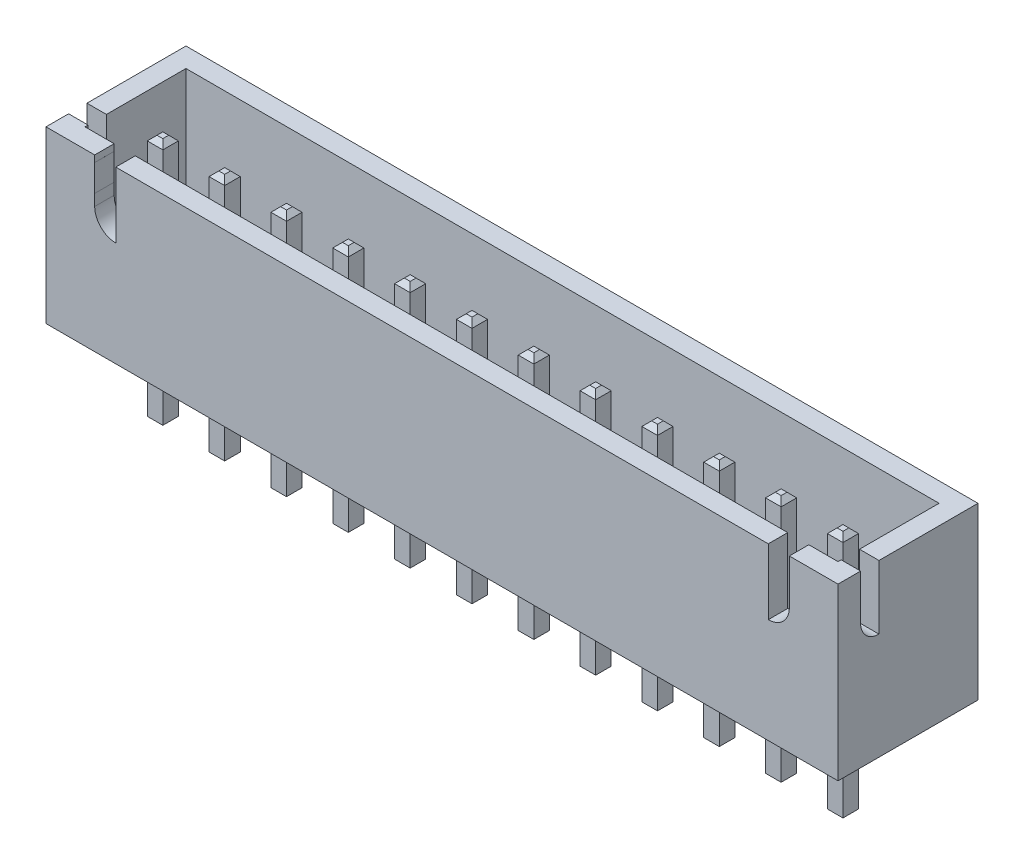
from build123d import *

# Parameters (mm, degrees)
SKETCH1_W                = 32.5374
SKETCH1_H                = 5.75
BOSS_EXTRUDE1_DEPTH      = 7
SHELL1_T                 = -0.8
CUT_EXTRUDE1_DEPTH       = 34.405808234
CUT_EXTRUDE2_REACH       = 20.621
BOSS_EXTRUDE2_DEPTH      = 3.45
BOSS_EXTRUDE2_DEPTH_BACK = 6.75
SKETCH4_W                = 0.64
SKETCH4_H                = 0.64
CHAMFER1_SIZE            = 0.2


with BuildPart() as part:
    # Sketch1 → Boss-Extrude1 (new body)
    with BuildSketch(Plane(origin=(0, 0, 0), x_dir=(1, 0, 0), z_dir=(0, 1, 0))):
        Rectangle(SKETCH1_W, SKETCH1_H)
    extrude(amount=BOSS_EXTRUDE1_DEPTH)

    # Shell1
    shell1_openings = [part.faces().sort_by_distance(p)[0] for p in [
        (0, 7, 0),
    ]]
    offset(amount=SHELL1_T, openings=shell1_openings, kind=Kind.INTERSECTION)

    # Sketch2 → Cut-Extrude1 (cut, through all)
    with BuildSketch(Plane(origin=(16.2687, 0, 0), x_dir=(0, 0, -1), z_dir=(1, 0, 0))):
        with BuildLine():
            Line((-1.19301282, 7), (-1.19301282, 4.379603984))
            ThreePointArc((-1.19301282, 4.379603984), (-1.72610374, 4.600417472), (-1.946917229, 5.133508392))
            Line((-1.946917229, 5.133508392), (-1.946917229, 7))
            Line((-1.946917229, 7), (-1.19301282, 7))
        make_face()
    extrude(amount=-CUT_EXTRUDE1_DEPTH, mode=Mode.SUBTRACT)

    # Sketch3 → Cut-Extrude2 (cut, up to next)
    with BuildSketch(Plane.XY.offset(2.875), mode=Mode.PRIVATE) as cut_extrude2_sk1:
        with BuildLine():
            Line((-14.2687, 7), (-14.2687, 6.728922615))
            Line((-14.2687, 6.728922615), (-14.2687, 5.629880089))
            Line((-14.2687, 5.629880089), (-14.2687, 5.166308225))
            ThreePointArc((-14.2687, 5.166308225), (-14.014986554, 4.553789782), (-13.40246811, 4.300076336))
            Line((-13.40246811, 4.300076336), (-13.40246811, 7))
            Line((-13.40246811, 7), (-14.2687, 7))
        make_face()
    cut_extrude2_tool1 = extrude(cut_extrude2_sk1.sketch, amount=-CUT_EXTRUDE2_REACH, mode=Mode.PRIVATE) & part.part
    # Sketch3 → Cut-Extrude2 (cut, up to next)
    with BuildSketch(Plane.XY.offset(2.875), mode=Mode.PRIVATE) as cut_extrude2_sk2:
        with BuildLine():
            Line((13.40246811, 7), (14.2687, 7))
            Line((14.2687, 7), (14.268076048, 6.728922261))
            Line((14.268076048, 6.728922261), (14.2687, 5.629880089))
            Line((14.2687, 5.629880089), (14.2687, 5.166308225))
            ThreePointArc((14.2687, 5.166308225), (14.014986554, 4.553789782), (13.40246811, 4.300076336))
            Line((13.40246811, 4.300076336), (13.40246811, 7))
        make_face()
    cut_extrude2_tool2 = extrude(cut_extrude2_sk2.sketch, amount=-CUT_EXTRUDE2_REACH, mode=Mode.PRIVATE) & part.part
    add(cut_extrude2_tool1.solids().sort_by_distance((-13.817865, 5.735551, 2.875))[0], mode=Mode.SUBTRACT)
    add(cut_extrude2_tool2.solids().sort_by_distance((13.817777, 5.735411, 2.875))[0], mode=Mode.SUBTRACT)

    # Sketch4 → Boss-Extrude2 (add, two sides: drawn at the far end of the back side and taken through both)
    with BuildSketch(Plane.XZ.offset(-BOSS_EXTRUDE2_DEPTH_BACK)):
        with Locations((-13.8187, 0.525)):
            Rectangle(SKETCH4_W, SKETCH4_H)
        with Locations((-11.2787, 0.525)):
            Rectangle(SKETCH4_W, SKETCH4_H)
        with Locations((-8.7387, 0.525)):
            Rectangle(SKETCH4_W, SKETCH4_H)
        with Locations((-6.1987, 0.525)):
            Rectangle(SKETCH4_W, SKETCH4_H)
        with Locations((-3.6587, 0.525)):
            Rectangle(SKETCH4_W, SKETCH4_H)
        with Locations((-1.1187, 0.525)):
            Rectangle(SKETCH4_W, SKETCH4_H)
        with Locations((1.4213, 0.525)):
            Rectangle(SKETCH4_W, SKETCH4_H)
        with Locations((3.9613, 0.525)):
            Rectangle(SKETCH4_W, SKETCH4_H)
        with Locations((6.5013, 0.525)):
            Rectangle(SKETCH4_W, SKETCH4_H)
        with Locations((9.0413, 0.525)):
            Rectangle(SKETCH4_W, SKETCH4_H)
        with Locations((11.5813, 0.525)):
            Rectangle(SKETCH4_W, SKETCH4_H)
        with Locations((14.1213, 0.525)):
            Rectangle(SKETCH4_W, SKETCH4_H)
    extrude(amount=BOSS_EXTRUDE2_DEPTH + BOSS_EXTRUDE2_DEPTH_BACK)

    # Chamfer1
    chamfer1_edges = [part.edges().sort_by_distance(p)[0] for p in [
        (-13.4987, 6.75, 0.525),
        (-13.8187, 6.75, 0.205),
        (-14.1387, 6.75, 0.525),
        (-13.8187, 6.75, 0.845),
        (-13.4987, -3.45, 0.525),
        (-13.8187, -3.45, 0.845),
        (-14.1387, -3.45, 0.525),
        (-13.8187, -3.45, 0.205),
        (-10.9587, 6.75, 0.525),
        (-11.2787, 6.75, 0.205),
        (-11.5987, 6.75, 0.525),
        (-11.2787, 6.75, 0.845),
        (-10.9587, -3.45, 0.525),
        (-11.2787, -3.45, 0.845),
        (-11.5987, -3.45, 0.525),
        (-11.2787, -3.45, 0.205),
        (-8.4187, 6.75, 0.525),
        (-8.7387, 6.75, 0.205),
        (-9.0587, 6.75, 0.525),
        (-8.7387, 6.75, 0.845),
        (-8.4187, -3.45, 0.525),
        (-8.7387, -3.45, 0.845),
        (-9.0587, -3.45, 0.525),
        (-8.7387, -3.45, 0.205),
        (-5.8787, 6.75, 0.525),
        (-6.1987, 6.75, 0.205),
        (-6.5187, 6.75, 0.525),
        (-6.1987, 6.75, 0.845),
        (-5.8787, -3.45, 0.525),
        (-6.1987, -3.45, 0.845),
        (-6.5187, -3.45, 0.525),
        (-6.1987, -3.45, 0.205),
        (-3.3387, 6.75, 0.525),
        (-3.6587, 6.75, 0.205),
        (-3.9787, 6.75, 0.525),
        (-3.6587, 6.75, 0.845),
        (-3.3387, -3.45, 0.525),
        (-3.6587, -3.45, 0.845),
        (-3.9787, -3.45, 0.525),
        (-3.6587, -3.45, 0.205),
        (-0.7987, 6.75, 0.525),
        (-1.1187, 6.75, 0.205),
        (-1.4387, 6.75, 0.525),
        (-1.1187, 6.75, 0.845),
        (-0.7987, -3.45, 0.525),
        (-1.1187, -3.45, 0.845),
        (-1.4387, -3.45, 0.525),
        (-1.1187, -3.45, 0.205),
        (1.7413, 6.75, 0.525),
        (1.4213, 6.75, 0.205),
        (1.1013, 6.75, 0.525),
        (1.4213, 6.75, 0.845),
        (1.7413, -3.45, 0.525),
        (1.4213, -3.45, 0.845),
        (1.1013, -3.45, 0.525),
        (1.4213, -3.45, 0.205),
        (4.2813, 6.75, 0.525),
        (3.9613, 6.75, 0.205),
        (3.6413, 6.75, 0.525),
        (3.9613, 6.75, 0.845),
        (4.2813, -3.45, 0.525),
        (3.9613, -3.45, 0.845),
        (3.6413, -3.45, 0.525),
        (3.9613, -3.45, 0.205),
        (6.8213, 6.75, 0.525),
        (6.5013, 6.75, 0.205),
        (6.1813, 6.75, 0.525),
        (6.5013, 6.75, 0.845),
        (6.8213, -3.45, 0.525),
        (6.5013, -3.45, 0.845),
        (6.1813, -3.45, 0.525),
        (6.5013, -3.45, 0.205),
        (9.3613, 6.75, 0.525),
        (9.0413, 6.75, 0.205),
        (8.7213, 6.75, 0.525),
        (9.0413, 6.75, 0.845),
        (9.3613, -3.45, 0.525),
        (9.0413, -3.45, 0.845),
        (8.7213, -3.45, 0.525),
        (9.0413, -3.45, 0.205),
        (11.9013, 6.75, 0.525),
        (11.5813, 6.75, 0.205),
        (11.2613, 6.75, 0.525),
        (11.5813, 6.75, 0.845),
        (11.9013, -3.45, 0.525),
        (11.5813, -3.45, 0.845),
        (11.2613, -3.45, 0.525),
        (11.5813, -3.45, 0.205),
        (14.4413, 6.75, 0.525),
        (14.1213, 6.75, 0.205),
        (13.8013, 6.75, 0.525),
        (14.1213, 6.75, 0.845),
        (14.4413, -3.45, 0.525),
        (14.1213, -3.45, 0.845),
        (13.8013, -3.45, 0.525),
        (14.1213, -3.45, 0.205),
    ]]
    chamfer(chamfer1_edges, length=CHAMFER1_SIZE)


solid = part.part
